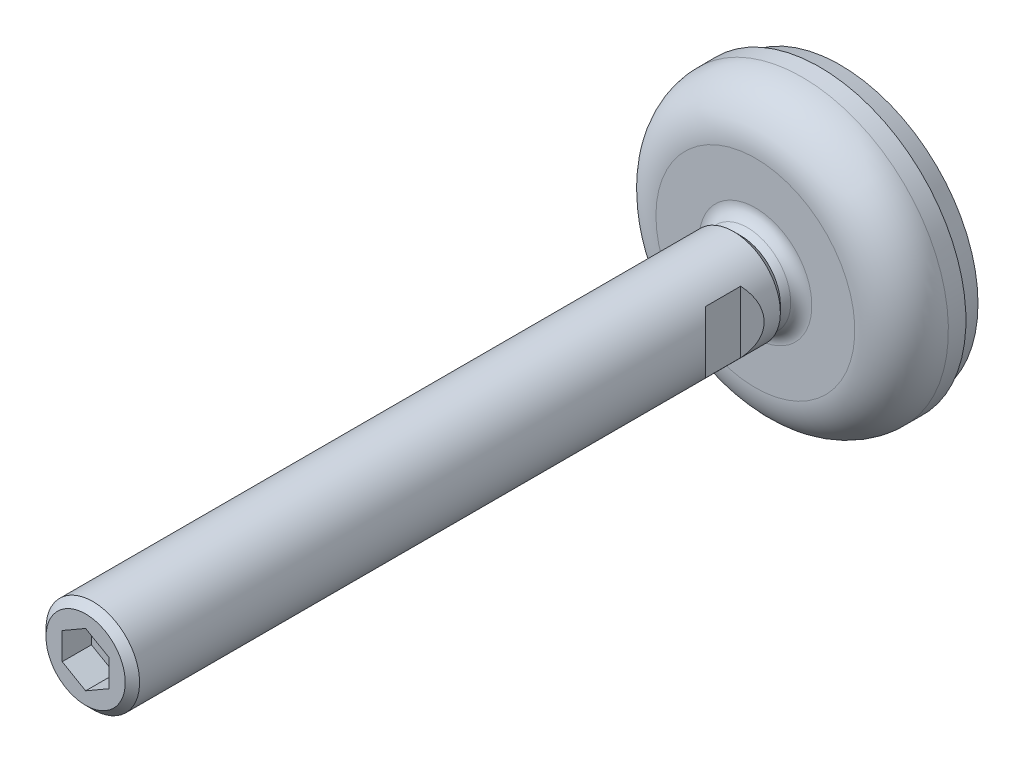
ISO-10303-21;
HEADER;
FILE_DESCRIPTION(('STEP AP214'),'2;1');
FILE_NAME('part.step','',(''),(''),'','','');
FILE_SCHEMA(('AUTOMOTIVE_DESIGN { 1 0 10303 214 1 1 1 1 }'));
ENDSEC;
DATA;
#1=APPLICATION_CONTEXT('core data for automotive mechanical design processes');
#2=APPLICATION_PROTOCOL_DEFINITION('international standard','automotive_design',2000,#1);
#3=PRODUCT_CONTEXT('',#1,'mechanical');
#4=PRODUCT('Part','Part','',(#3));
#5=PRODUCT_RELATED_PRODUCT_CATEGORY('part','',(#4));
#6=PRODUCT_DEFINITION_FORMATION('','',#4);
#7=PRODUCT_DEFINITION_CONTEXT('part definition',#1,'design');
#8=PRODUCT_DEFINITION('design','',#6,#7);
#9=PRODUCT_DEFINITION_SHAPE('','',#8);
#10=(LENGTH_UNIT() NAMED_UNIT(*) SI_UNIT(.MILLI.,.METRE.));
#11=(NAMED_UNIT(*) PLANE_ANGLE_UNIT() SI_UNIT($,.RADIAN.));
#12=(NAMED_UNIT(*) SI_UNIT($,.STERADIAN.) SOLID_ANGLE_UNIT());
#13=UNCERTAINTY_MEASURE_WITH_UNIT(LENGTH_MEASURE(1.E-05),#10,'distance_accuracy_value','');
#14=(GEOMETRIC_REPRESENTATION_CONTEXT(3) GLOBAL_UNCERTAINTY_ASSIGNED_CONTEXT((#13)) GLOBAL_UNIT_ASSIGNED_CONTEXT((#10,
#11,#12)) REPRESENTATION_CONTEXT('',''));
#15=CARTESIAN_POINT('',(0.,0.,0.));
#16=DIRECTION('',(0.,0.,1.));
#17=DIRECTION('',(1.,0.,0.));
#18=AXIS2_PLACEMENT_3D('',#15,#16,#17);
#19=CARTESIAN_POINT('',(0.,0.,18.227));
#20=DIRECTION('',(0.,0.,-1.));
#21=DIRECTION('',(-1.,0.,0.));
#22=AXIS2_PLACEMENT_3D('',#19,#20,#21);
#23=CYLINDRICAL_SURFACE('',#22,8.);
#24=CARTESIAN_POINT('',(0.,0.,23.));
#25=DIRECTION('',(-0.707106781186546,0.,0.707106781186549));
#26=DIRECTION('',(-0.707106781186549,0.,-0.707106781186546));
#27=AXIS2_PLACEMENT_3D('',#24,#25,#26);
#28=ELLIPSE('',#27,11.3137084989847,8.);
#29=CARTESIAN_POINT('',(6.,5.29150262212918,29.));
#30=VERTEX_POINT('',#29);
#31=CARTESIAN_POINT('',(6.,-5.29150262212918,29.));
#32=VERTEX_POINT('',#31);
#33=EDGE_CURVE('E9',#30,#32,#28,.F.);
#34=ORIENTED_EDGE('',*,*,#33,.F.);
#35=DIRECTION('',(0.,0.,-1.));
#36=VECTOR('',#35,1.);
#37=CARTESIAN_POINT('',(6.,5.29150262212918,18.227));
#38=LINE('',#37,#36);
#39=CARTESIAN_POINT('',(6.,5.29150262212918,23.));
#40=VERTEX_POINT('',#39);
#41=EDGE_CURVE('E22',#40,#30,#38,.F.);
#42=ORIENTED_EDGE('',*,*,#41,.F.);
#43=CARTESIAN_POINT('',(0.,0.,29.));
#44=DIRECTION('',(-0.707106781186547,0.,-0.707106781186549));
#45=DIRECTION('',(0.707106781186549,0.,-0.707106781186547));
#46=AXIS2_PLACEMENT_3D('',#43,#44,#45);
#47=ELLIPSE('',#46,11.3137084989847,8.);
#48=CARTESIAN_POINT('',(6.,-5.29150262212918,23.));
#49=VERTEX_POINT('',#48);
#50=EDGE_CURVE('E89',#49,#40,#47,.F.);
#51=ORIENTED_EDGE('',*,*,#50,.F.);
#52=DIRECTION('',(0.,0.,-1.));
#53=VECTOR('',#52,1.);
#54=CARTESIAN_POINT('',(6.,-5.29150262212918,18.227));
#55=LINE('',#54,#53);
#56=EDGE_CURVE('E94',#32,#49,#55,.T.);
#57=ORIENTED_EDGE('',*,*,#56,.F.);
#58=EDGE_LOOP('',(#34,#42,#51,#57));
#59=FACE_BOUND('',#58,.T.);
#60=DIRECTION('',(0.,0.,-1.));
#61=VECTOR('',#60,1.);
#62=CARTESIAN_POINT('',(-6.,-5.29150262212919,18.227));
#63=LINE('',#62,#61);
#64=CARTESIAN_POINT('',(-6.,-5.29150262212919,23.));
#65=VERTEX_POINT('',#64);
#66=CARTESIAN_POINT('',(-6.,-5.29150262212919,29.));
#67=VERTEX_POINT('',#66);
#68=EDGE_CURVE('E95',#65,#67,#63,.F.);
#69=ORIENTED_EDGE('',*,*,#68,.F.);
#70=CARTESIAN_POINT('',(0.,0.,29.));
#71=DIRECTION('',(0.707106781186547,0.,-0.707106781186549));
#72=DIRECTION('',(-0.707106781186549,0.,-0.707106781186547));
#73=AXIS2_PLACEMENT_3D('',#70,#71,#72);
#74=ELLIPSE('',#73,11.3137084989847,8.);
#75=CARTESIAN_POINT('',(-6.,5.29150262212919,23.));
#76=VERTEX_POINT('',#75);
#77=EDGE_CURVE('E110',#76,#65,#74,.F.);
#78=ORIENTED_EDGE('',*,*,#77,.F.);
#79=DIRECTION('',(0.,0.,-1.));
#80=VECTOR('',#79,1.);
#81=CARTESIAN_POINT('',(-6.,5.29150262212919,18.227));
#82=LINE('',#81,#80);
#83=CARTESIAN_POINT('',(-6.,5.29150262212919,29.));
#84=VERTEX_POINT('',#83);
#85=EDGE_CURVE('E112',#84,#76,#82,.T.);
#86=ORIENTED_EDGE('',*,*,#85,.F.);
#87=CARTESIAN_POINT('',(0.,0.,23.));
#88=DIRECTION('',(0.707106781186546,0.,0.707106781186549));
#89=DIRECTION('',(0.707106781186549,0.,-0.707106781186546));
#90=AXIS2_PLACEMENT_3D('',#87,#88,#89);
#91=ELLIPSE('',#90,11.3137084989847,8.);
#92=EDGE_CURVE('E108',#67,#84,#91,.F.);
#93=ORIENTED_EDGE('',*,*,#92,.F.);
#94=EDGE_LOOP('',(#69,#78,#86,#93));
#95=FACE_BOUND('',#94,.T.);
#96=CARTESIAN_POINT('',(0.,0.,127.773));
#97=DIRECTION('',(0.,0.,-1.));
#98=DIRECTION('',(0.,1.,0.));
#99=AXIS2_PLACEMENT_3D('',#96,#97,#98);
#100=CIRCLE('',#99,8.);
#101=CARTESIAN_POINT('',(0.,8.,127.773));
#102=VERTEX_POINT('',#101);
#103=EDGE_CURVE('E118',#102,#102,#100,.T.);
#104=ORIENTED_EDGE('',*,*,#103,.T.);
#105=EDGE_LOOP('',(#104));
#106=FACE_BOUND('',#105,.T.);
#107=CARTESIAN_POINT('',(0.,0.,18.227));
#108=DIRECTION('',(0.,0.,-1.));
#109=DIRECTION('',(0.,1.,0.));
#110=AXIS2_PLACEMENT_3D('',#107,#108,#109);
#111=CIRCLE('',#110,8.);
#112=CARTESIAN_POINT('',(0.,8.,18.227));
#113=VERTEX_POINT('',#112);
#114=EDGE_CURVE('E138',#113,#113,#111,.T.);
#115=ORIENTED_EDGE('',*,*,#114,.F.);
#116=EDGE_LOOP('',(#115));
#117=FACE_BOUND('',#116,.T.);
#118=ADVANCED_FACE('F14',(#59,#95,#106,#117),#23,.T.);
#119=CARTESIAN_POINT('',(0.,0.,17.));
#120=DIRECTION('',(0.,0.,1.));
#121=DIRECTION('',(1.,0.,0.));
#122=AXIS2_PLACEMENT_3D('',#119,#120,#121);
#123=CONICAL_SURFACE('',#122,6.773,0.785398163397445);
#124=ORIENTED_EDGE('',*,*,#114,.T.);
#125=EDGE_LOOP('',(#124));
#126=FACE_BOUND('',#125,.T.);
#127=CARTESIAN_POINT('',(0.,0.,17.));
#128=DIRECTION('',(0.,0.,-1.));
#129=DIRECTION('',(-1.,0.,0.));
#130=AXIS2_PLACEMENT_3D('',#127,#128,#129);
#131=CIRCLE('',#130,6.773);
#132=CARTESIAN_POINT('',(-6.773,0.,17.));
#133=VERTEX_POINT('',#132);
#134=EDGE_CURVE('E141',#133,#133,#131,.T.);
#135=ORIENTED_EDGE('',*,*,#134,.F.);
#136=EDGE_LOOP('',(#135));
#137=FACE_BOUND('',#136,.T.);
#138=ADVANCED_FACE('F205',(#126,#137),#123,.T.);
#139=CARTESIAN_POINT('',(2.40883454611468,0.,10.942449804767));
#140=DIRECTION('',(0.,1.,0.));
#141=DIRECTION('',(-0.218984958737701,0.,-0.975728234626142));
#142=AXIS2_PLACEMENT_3D('',#139,#140,#141);
#143=CIRCLE('',#142,10.9999999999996);
#144=TRIMMED_CURVE('',#143,(PARAMETER_VALUE(0.)),(PARAMETER_VALUE(2.70004453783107)),.T.,.PARAMETER.);
#145=CARTESIAN_POINT('',(0.,0.,10.942449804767));
#146=DIRECTION('',(0.,0.,-1.));
#147=AXIS1_PLACEMENT('',#145,#146);
#148=SURFACE_OF_REVOLUTION('',#144,#147);
#149=ORIENTED_EDGE('',*,*,#134,.T.);
#150=EDGE_LOOP('',(#149));
#151=FACE_BOUND('',#150,.T.);
#152=CARTESIAN_POINT('',(0.,0.,15.8782314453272));
#153=DIRECTION('',(0.,0.,-1.));
#154=DIRECTION('',(-1.,0.,0.));
#155=AXIS2_PLACEMENT_3D('',#152,#153,#154);
#156=CIRCLE('',#155,7.42163134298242);
#157=CARTESIAN_POINT('',(-7.42163134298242,0.,15.8782314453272));
#158=VERTEX_POINT('',#157);
#159=EDGE_CURVE('E124',#158,#158,#156,.T.);
#160=ORIENTED_EDGE('',*,*,#159,.F.);
#161=EDGE_LOOP('',(#160));
#162=FACE_BOUND('',#161,.T.);
#163=ADVANCED_FACE('F211',(#151,#162),#148,.F.);
#164=CARTESIAN_POINT('',(0.,0.,17.));
#165=DIRECTION('',(0.,0.,-1.));
#166=DIRECTION('',(-1.,0.,0.));
#167=AXIS2_PLACEMENT_3D('',#164,#165,#166);
#168=TOROIDAL_SURFACE('',#167,9.65582813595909,2.5);
#169=CARTESIAN_POINT('',(0.,0.,14.5));
#170=DIRECTION('',(0.,0.,-1.));
#171=DIRECTION('',(-1.,0.,0.));
#172=AXIS2_PLACEMENT_3D('',#169,#170,#171);
#173=CIRCLE('',#172,9.65582813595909);
#174=CARTESIAN_POINT('',(-9.65582813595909,0.,14.5));
#175=VERTEX_POINT('',#174);
#176=EDGE_CURVE('E120',#175,#175,#173,.T.);
#177=ORIENTED_EDGE('',*,*,#176,.F.);
#178=EDGE_LOOP('',(#177));
#179=FACE_BOUND('',#178,.T.);
#180=ORIENTED_EDGE('',*,*,#159,.T.);
#181=EDGE_LOOP('',(#180));
#182=FACE_BOUND('',#181,.T.);
#183=ADVANCED_FACE('F220',(#179,#182),#168,.F.);
#184=CARTESIAN_POINT('',(-17.,17.,14.5));
#185=CARTESIAN_POINT('',(-17.,-17.,14.5));
#186=CARTESIAN_POINT('',(-17.,-17.34,14.5));
#187=B_SPLINE_CURVE_WITH_KNOTS('',1,(#184,#185,#186),.UNSPECIFIED.,.F.,.F.,(2,1,2),(0.,1.,1.01),.UNSPECIFIED.);
#188=DIRECTION('',(1.,0.,0.));
#189=VECTOR('',#188,1.);
#190=SURFACE_OF_LINEAR_EXTRUSION('',#187,#189);
#191=ORIENTED_EDGE('',*,*,#176,.T.);
#192=EDGE_LOOP('',(#191));
#193=FACE_BOUND('',#192,.T.);
#194=CARTESIAN_POINT('',(0.,0.,14.5));
#195=DIRECTION('',(0.,0.,-1.));
#196=DIRECTION('',(-1.,0.,0.));
#197=AXIS2_PLACEMENT_3D('',#194,#195,#196);
#198=CIRCLE('',#197,17.);
#199=CARTESIAN_POINT('',(-17.,0.,14.5));
#200=VERTEX_POINT('',#199);
#201=EDGE_CURVE('E123',#200,#200,#198,.T.);
#202=ORIENTED_EDGE('',*,*,#201,.F.);
#203=EDGE_LOOP('',(#202));
#204=FACE_BOUND('',#203,.T.);
#205=ADVANCED_FACE('F160',(#193,#204),#190,.T.);
#206=CARTESIAN_POINT('',(0.,0.,6.5));
#207=DIRECTION('',(0.,0.,-1.));
#208=DIRECTION('',(-1.,0.,0.));
#209=AXIS2_PLACEMENT_3D('',#206,#207,#208);
#210=TOROIDAL_SURFACE('',#209,17.,8.);
#211=ORIENTED_EDGE('',*,*,#201,.T.);
#212=EDGE_LOOP('',(#211));
#213=FACE_BOUND('',#212,.T.);
#214=CARTESIAN_POINT('',(0.,0.,6.5));
#215=DIRECTION('',(0.,0.,-1.));
#216=DIRECTION('',(0.,1.,0.));
#217=AXIS2_PLACEMENT_3D('',#214,#215,#216);
#218=CIRCLE('',#217,25.);
#219=CARTESIAN_POINT('',(0.,25.,6.5));
#220=VERTEX_POINT('',#219);
#221=EDGE_CURVE('E127',#220,#220,#218,.T.);
#222=ORIENTED_EDGE('',*,*,#221,.F.);
#223=EDGE_LOOP('',(#222));
#224=FACE_BOUND('',#223,.T.);
#225=ADVANCED_FACE('F155',(#213,#224),#210,.T.);
#226=CARTESIAN_POINT('',(0.,0.,3.5));
#227=DIRECTION('',(0.,0.,-1.));
#228=DIRECTION('',(-1.,0.,0.));
#229=AXIS2_PLACEMENT_3D('',#226,#227,#228);
#230=CYLINDRICAL_SURFACE('',#229,25.);
#231=CARTESIAN_POINT('',(0.,0.,3.5));
#232=DIRECTION('',(0.,0.,-1.));
#233=DIRECTION('',(-1.,0.,0.));
#234=AXIS2_PLACEMENT_3D('',#231,#232,#233);
#235=CIRCLE('',#234,25.);
#236=CARTESIAN_POINT('',(-25.,0.,3.5));
#237=VERTEX_POINT('',#236);
#238=EDGE_CURVE('E128',#237,#237,#235,.T.);
#239=ORIENTED_EDGE('',*,*,#238,.F.);
#240=EDGE_LOOP('',(#239));
#241=FACE_BOUND('',#240,.T.);
#242=ORIENTED_EDGE('',*,*,#221,.T.);
#243=EDGE_LOOP('',(#242));
#244=FACE_BOUND('',#243,.T.);
#245=ADVANCED_FACE('F159',(#241,#244),#230,.T.);
#246=CARTESIAN_POINT('',(-25.3000021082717,-25.,3.5));
#247=DIRECTION('',(0.,0.,-1.));
#248=DIRECTION('',(0.,1.,0.));
#249=AXIS2_PLACEMENT_3D('',#246,#247,#248);
#250=PLANE('',#249);
#251=CARTESIAN_POINT('',(0.,0.,3.5));
#252=DIRECTION('',(0.,0.,1.));
#253=DIRECTION('',(1.,0.,0.));
#254=AXIS2_PLACEMENT_3D('',#251,#252,#253);
#255=CIRCLE('',#254,24.5);
#256=CARTESIAN_POINT('',(24.5,0.,3.5));
#257=VERTEX_POINT('',#256);
#258=EDGE_CURVE('E131',#257,#257,#255,.F.);
#259=ORIENTED_EDGE('',*,*,#258,.F.);
#260=EDGE_LOOP('',(#259));
#261=FACE_BOUND('',#260,.T.);
#262=ORIENTED_EDGE('',*,*,#238,.T.);
#263=EDGE_LOOP('',(#262));
#264=FACE_BOUND('',#263,.T.);
#265=ADVANCED_FACE('F165',(#261,#264),#250,.T.);
#266=CARTESIAN_POINT('',(-23.844926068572,-23.562177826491,0.));
#267=DIRECTION('',(0.,0.,-1.));
#268=DIRECTION('',(0.,1.,0.));
#269=AXIS2_PLACEMENT_3D('',#266,#267,#268);
#270=PLANE('',#269);
#271=CARTESIAN_POINT('',(0.,0.,0.));
#272=DIRECTION('',(0.,0.,1.));
#273=DIRECTION('',(1.,0.,0.));
#274=AXIS2_PLACEMENT_3D('',#271,#272,#273);
#275=CIRCLE('',#274,23.562177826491);
#276=CARTESIAN_POINT('',(23.562177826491,0.,0.));
#277=VERTEX_POINT('',#276);
#278=EDGE_CURVE('E114',#277,#277,#275,.T.);
#279=ORIENTED_EDGE('',*,*,#278,.F.);
#280=EDGE_LOOP('',(#279));
#281=FACE_BOUND('',#280,.T.);
#282=ADVANCED_FACE('F168',(#281),#270,.T.);
#283=CARTESIAN_POINT('',(0.,0.,0.));
#284=DIRECTION('',(0.,0.,1.));
#285=DIRECTION('',(1.,0.,0.));
#286=AXIS2_PLACEMENT_3D('',#283,#284,#285);
#287=CONICAL_SURFACE('',#286,23.562177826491,0.26179938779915);
#288=ORIENTED_EDGE('',*,*,#258,.T.);
#289=EDGE_LOOP('',(#288));
#290=FACE_BOUND('',#289,.T.);
#291=ORIENTED_EDGE('',*,*,#278,.T.);
#292=EDGE_LOOP('',(#291));
#293=FACE_BOUND('',#292,.T.);
#294=ADVANCED_FACE('F16',(#290,#293),#287,.T.);
#295=CARTESIAN_POINT('',(-4.,-4.67422777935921,124.));
#296=DIRECTION('',(0.,0.,1.));
#297=DIRECTION('',(1.,0.,0.));
#298=AXIS2_PLACEMENT_3D('',#295,#296,#297);
#299=PLANE('',#298);
#300=DIRECTION('',(0.866025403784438,0.5,0.));
#301=VECTOR('',#300,1.);
#302=CARTESIAN_POINT('',(-2.,3.46410161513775,124.));
#303=LINE('',#302,#301);
#304=CARTESIAN_POINT('',(-4.,2.3094010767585,124.));
#305=VERTEX_POINT('',#304);
#306=CARTESIAN_POINT('',(1.08254317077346E-07,4.61880209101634,124.));
#307=VERTEX_POINT('',#306);
#308=EDGE_CURVE('E317',#305,#307,#303,.T.);
#309=ORIENTED_EDGE('',*,*,#308,.F.);
#310=DIRECTION('',(0.,1.,0.));
#311=VECTOR('',#310,1.);
#312=CARTESIAN_POINT('',(-4.,0.,124.));
#313=LINE('',#312,#311);
#314=CARTESIAN_POINT('',(-4.,-2.3094010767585,124.));
#315=VERTEX_POINT('',#314);
#316=EDGE_CURVE('E311',#315,#305,#313,.T.);
#317=ORIENTED_EDGE('',*,*,#316,.F.);
#318=DIRECTION('',(-0.866025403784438,0.5,0.));
#319=VECTOR('',#318,1.);
#320=CARTESIAN_POINT('',(-2.,-3.46410161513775,124.));
#321=LINE('',#320,#319);
#322=CARTESIAN_POINT('',(-2.16508673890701E-07,-4.61880202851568,124.));
#323=VERTEX_POINT('',#322);
#324=EDGE_CURVE('E308',#323,#315,#321,.T.);
#325=ORIENTED_EDGE('',*,*,#324,.F.);
#326=DIRECTION('',(-0.866025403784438,-0.5,0.));
#327=VECTOR('',#326,1.);
#328=CARTESIAN_POINT('',(2.,-3.46410161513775,124.));
#329=LINE('',#328,#327);
#330=CARTESIAN_POINT('',(4.,-2.3094010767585,124.));
#331=VERTEX_POINT('',#330);
#332=EDGE_CURVE('E300',#331,#323,#329,.T.);
#333=ORIENTED_EDGE('',*,*,#332,.F.);
#334=DIRECTION('',(0.,-1.,0.));
#335=VECTOR('',#334,1.);
#336=CARTESIAN_POINT('',(4.,0.,124.));
#337=LINE('',#336,#335);
#338=CARTESIAN_POINT('',(4.,2.3094010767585,124.));
#339=VERTEX_POINT('',#338);
#340=EDGE_CURVE('E292',#339,#331,#337,.T.);
#341=ORIENTED_EDGE('',*,*,#340,.F.);
#342=DIRECTION('',(0.866025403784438,-0.5,0.));
#343=VECTOR('',#342,1.);
#344=CARTESIAN_POINT('',(2.,3.46410161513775,124.));
#345=LINE('',#344,#343);
#346=EDGE_CURVE('E289',#307,#339,#345,.T.);
#347=ORIENTED_EDGE('',*,*,#346,.F.);
#348=EDGE_LOOP('',(#309,#317,#325,#333,#341,#347));
#349=FACE_BOUND('',#348,.T.);
#350=ADVANCED_FACE('F177',(#349),#299,.T.);
#351=CARTESIAN_POINT('',(4.,2.3094010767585,129.));
#352=DIRECTION('',(-0.5,-0.866025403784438,0.));
#353=DIRECTION('',(-0.866025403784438,0.5,0.));
#354=AXIS2_PLACEMENT_3D('',#351,#352,#353);
#355=PLANE('',#354);
#356=ORIENTED_EDGE('',*,*,#346,.T.);
#357=DIRECTION('',(0.,0.,-1.));
#358=VECTOR('',#357,1.);
#359=CARTESIAN_POINT('',(4.,2.3094010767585,129.));
#360=LINE('',#359,#358);
#361=CARTESIAN_POINT('',(4.,2.3094010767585,129.));
#362=VERTEX_POINT('',#361);
#363=EDGE_CURVE('E287',#362,#339,#360,.T.);
#364=ORIENTED_EDGE('',*,*,#363,.F.);
#365=CARTESIAN_POINT('',(0.,4.61880215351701,129.));
#366=CARTESIAN_POINT('',(0.166666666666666,4.52257710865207,129.));
#367=CARTESIAN_POINT('',(0.333333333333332,4.42635206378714,129.));
#368=CARTESIAN_POINT('',(0.666666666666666,4.23390197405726,129.));
#369=CARTESIAN_POINT('',(0.833333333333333,4.13767692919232,129.));
#370=CARTESIAN_POINT('',(1.16666666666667,3.94522683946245,129.));
#371=CARTESIAN_POINT('',(1.33333333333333,3.84900179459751,129.));
#372=CARTESIAN_POINT('',(1.66666666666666,3.65655170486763,129.));
#373=CARTESIAN_POINT('',(1.83333333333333,3.56032666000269,129.));
#374=CARTESIAN_POINT('',(2.16666666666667,3.36787657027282,129.));
#375=CARTESIAN_POINT('',(2.33333333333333,3.27165152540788,129.));
#376=CARTESIAN_POINT('',(2.66666666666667,3.079201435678,129.));
#377=CARTESIAN_POINT('',(2.83333333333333,2.98297639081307,129.));
#378=CARTESIAN_POINT('',(3.16666666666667,2.79052630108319,129.));
#379=CARTESIAN_POINT('',(3.33333333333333,2.69430125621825,129.));
#380=CARTESIAN_POINT('',(3.66666666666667,2.50185116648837,129.));
#381=CARTESIAN_POINT('',(3.83333333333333,2.40562612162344,129.));
#382=CARTESIAN_POINT('',(4.,2.3094010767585,129.));
#383=B_SPLINE_CURVE_WITH_KNOTS('',3,(#365,#366,#367,#368,#369,#370,#371,#372,#373,#374,#375,
#376,#377,#378,#379,#380,#381,#382),.UNSPECIFIED.,.F.,.F.,(4,2,2,2,2,2,2,2,4),(0.,
0.577350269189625,1.15470053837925,1.73205080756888,2.3094010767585,2.88675134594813,
3.46410161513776,4.04145188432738,4.61880215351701),.UNSPECIFIED.);
#384=CARTESIAN_POINT('',(-6.2517213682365E-08,4.61880211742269,129.));
#385=VERTEX_POINT('',#384);
#386=EDGE_CURVE('E233',#385,#362,#383,.T.);
#387=ORIENTED_EDGE('',*,*,#386,.F.);
#388=DIRECTION('',(0.,0.,-1.));
#389=VECTOR('',#388,1.);
#390=CARTESIAN_POINT('',(0.,4.61880215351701,129.));
#391=LINE('',#390,#389);
#392=EDGE_CURVE('E285',#385,#307,#391,.T.);
#393=ORIENTED_EDGE('',*,*,#392,.T.);
#394=EDGE_LOOP('',(#356,#364,#387,#393));
#395=FACE_BOUND('',#394,.T.);
#396=ADVANCED_FACE('F185',(#395),#355,.T.);
#397=CARTESIAN_POINT('',(0.,4.61880215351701,129.));
#398=DIRECTION('',(0.5,-0.866025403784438,0.));
#399=DIRECTION('',(-0.866025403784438,-0.5,0.));
#400=AXIS2_PLACEMENT_3D('',#397,#398,#399);
#401=PLANE('',#400);
#402=ORIENTED_EDGE('',*,*,#308,.T.);
#403=ORIENTED_EDGE('',*,*,#392,.F.);
#404=CARTESIAN_POINT('',(-4.,2.3094010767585,129.));
#405=CARTESIAN_POINT('',(-3.83333333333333,2.40562612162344,129.));
#406=CARTESIAN_POINT('',(-3.66666666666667,2.50185116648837,129.));
#407=CARTESIAN_POINT('',(-3.33333333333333,2.69430125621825,129.));
#408=CARTESIAN_POINT('',(-3.16666666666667,2.79052630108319,129.));
#409=CARTESIAN_POINT('',(-2.83333333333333,2.98297639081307,129.));
#410=CARTESIAN_POINT('',(-2.66666666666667,3.079201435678,129.));
#411=CARTESIAN_POINT('',(-2.33333333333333,3.27165152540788,129.));
#412=CARTESIAN_POINT('',(-2.16666666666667,3.36787657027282,129.));
#413=CARTESIAN_POINT('',(-1.83333333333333,3.56032666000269,129.));
#414=CARTESIAN_POINT('',(-1.66666666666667,3.65655170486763,129.));
#415=CARTESIAN_POINT('',(-1.33333333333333,3.84900179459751,129.));
#416=CARTESIAN_POINT('',(-1.16666666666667,3.94522683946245,129.));
#417=CARTESIAN_POINT('',(-0.833333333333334,4.13767692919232,129.));
#418=CARTESIAN_POINT('',(-0.666666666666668,4.23390197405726,129.));
#419=CARTESIAN_POINT('',(-0.333333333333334,4.42635206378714,129.));
#420=CARTESIAN_POINT('',(-0.166666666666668,4.52257710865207,129.));
#421=CARTESIAN_POINT('',(0.,4.61880215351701,129.));
#422=B_SPLINE_CURVE_WITH_KNOTS('',3,(#404,#405,#406,#407,#408,#409,#410,#411,#412,#413,#414,
#415,#416,#417,#418,#419,#420,#421),.UNSPECIFIED.,.F.,.F.,(4,2,2,2,2,2,2,2,4),(0.,
0.577350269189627,1.15470053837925,1.73205080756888,2.3094010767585,2.88675134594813,
3.46410161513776,4.04145188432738,4.61880215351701),.UNSPECIFIED.);
#423=CARTESIAN_POINT('',(-4.,2.3094010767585,129.));
#424=VERTEX_POINT('',#423);
#425=EDGE_CURVE('E228',#424,#385,#422,.T.);
#426=ORIENTED_EDGE('',*,*,#425,.F.);
#427=DIRECTION('',(0.,0.,-1.));
#428=VECTOR('',#427,1.);
#429=CARTESIAN_POINT('',(-4.,2.3094010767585,129.));
#430=LINE('',#429,#428);
#431=EDGE_CURVE('E315',#424,#305,#430,.T.);
#432=ORIENTED_EDGE('',*,*,#431,.T.);
#433=EDGE_LOOP('',(#402,#403,#426,#432));
#434=FACE_BOUND('',#433,.T.);
#435=ADVANCED_FACE('F198',(#434),#401,.T.);
#436=CARTESIAN_POINT('',(-4.,2.3094010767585,129.));
#437=DIRECTION('',(1.,0.,0.));
#438=DIRECTION('',(0.,-1.,0.));
#439=AXIS2_PLACEMENT_3D('',#436,#437,#438);
#440=PLANE('',#439);
#441=ORIENTED_EDGE('',*,*,#316,.T.);
#442=ORIENTED_EDGE('',*,*,#431,.F.);
#443=DIRECTION('',(0.,1.,0.));
#444=VECTOR('',#443,1.);
#445=CARTESIAN_POINT('',(-4.,0.,129.));
#446=LINE('',#445,#444);
#447=CARTESIAN_POINT('',(-4.,-2.3094010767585,129.));
#448=VERTEX_POINT('',#447);
#449=EDGE_CURVE('E224',#448,#424,#446,.T.);
#450=ORIENTED_EDGE('',*,*,#449,.F.);
#451=DIRECTION('',(0.,0.,-1.));
#452=VECTOR('',#451,1.);
#453=CARTESIAN_POINT('',(-4.,-2.3094010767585,129.));
#454=LINE('',#453,#452);
#455=EDGE_CURVE('E307',#448,#315,#454,.T.);
#456=ORIENTED_EDGE('',*,*,#455,.T.);
#457=EDGE_LOOP('',(#441,#442,#450,#456));
#458=FACE_BOUND('',#457,.T.);
#459=ADVANCED_FACE('F313',(#458),#440,.T.);
#460=CARTESIAN_POINT('',(-4.,-2.3094010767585,129.));
#461=DIRECTION('',(0.5,0.866025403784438,0.));
#462=DIRECTION('',(0.866025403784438,-0.5,0.));
#463=AXIS2_PLACEMENT_3D('',#460,#461,#462);
#464=PLANE('',#463);
#465=ORIENTED_EDGE('',*,*,#324,.T.);
#466=ORIENTED_EDGE('',*,*,#455,.F.);
#467=CARTESIAN_POINT('',(0.,-4.61880215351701,129.));
#468=CARTESIAN_POINT('',(-0.166666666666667,-4.52257710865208,129.));
#469=CARTESIAN_POINT('',(-0.333333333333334,-4.42635206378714,129.));
#470=CARTESIAN_POINT('',(-0.666666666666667,-4.23390197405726,129.));
#471=CARTESIAN_POINT('',(-0.833333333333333,-4.13767692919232,129.));
#472=CARTESIAN_POINT('',(-1.16666666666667,-3.94522683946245,129.));
#473=CARTESIAN_POINT('',(-1.33333333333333,-3.84900179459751,129.));
#474=CARTESIAN_POINT('',(-1.66666666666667,-3.65655170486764,129.));
#475=CARTESIAN_POINT('',(-1.83333333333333,-3.5603266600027,129.));
#476=CARTESIAN_POINT('',(-2.16666666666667,-3.36787657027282,129.));
#477=CARTESIAN_POINT('',(-2.33333333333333,-3.27165152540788,129.));
#478=CARTESIAN_POINT('',(-2.66666666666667,-3.07920143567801,129.));
#479=CARTESIAN_POINT('',(-2.83333333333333,-2.98297639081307,129.));
#480=CARTESIAN_POINT('',(-3.16666666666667,-2.7905263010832,129.));
#481=CARTESIAN_POINT('',(-3.33333333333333,-2.69430125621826,129.));
#482=CARTESIAN_POINT('',(-3.66666666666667,-2.50185116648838,129.));
#483=CARTESIAN_POINT('',(-3.83333333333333,-2.40562612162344,129.));
#484=CARTESIAN_POINT('',(-4.,-2.30940107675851,129.));
#485=B_SPLINE_CURVE_WITH_KNOTS('',3,(#467,#468,#469,#470,#471,#472,#473,#474,#475,#476,#477,
#478,#479,#480,#481,#482,#483,#484),.UNSPECIFIED.,.F.,.F.,(4,2,2,2,2,2,2,2,4),(0.,
0.577350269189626,1.15470053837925,1.73205080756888,2.3094010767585,2.88675134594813,
3.46410161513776,4.04145188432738,4.61880215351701),.UNSPECIFIED.);
#486=CARTESIAN_POINT('',(-6.25172143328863E-08,-4.61880211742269,129.));
#487=VERTEX_POINT('',#486);
#488=EDGE_CURVE('E229',#487,#448,#485,.T.);
#489=ORIENTED_EDGE('',*,*,#488,.F.);
#490=DIRECTION('',(0.,0.,-1.));
#491=VECTOR('',#490,1.);
#492=CARTESIAN_POINT('',(0.,-4.61880215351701,129.));
#493=LINE('',#492,#491);
#494=EDGE_CURVE('E265',#323,#487,#493,.F.);
#495=ORIENTED_EDGE('',*,*,#494,.F.);
#496=EDGE_LOOP('',(#465,#466,#489,#495));
#497=FACE_BOUND('',#496,.T.);
#498=ADVANCED_FACE('F305',(#497),#464,.T.);
#499=CARTESIAN_POINT('',(0.,-4.61880215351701,129.));
#500=DIRECTION('',(-0.5,0.866025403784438,0.));
#501=DIRECTION('',(0.866025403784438,0.5,0.));
#502=AXIS2_PLACEMENT_3D('',#499,#500,#501);
#503=PLANE('',#502);
#504=ORIENTED_EDGE('',*,*,#332,.T.);
#505=ORIENTED_EDGE('',*,*,#494,.T.);
#506=CARTESIAN_POINT('',(4.,-2.30940107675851,129.));
#507=CARTESIAN_POINT('',(3.83333333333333,-2.40562612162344,129.));
#508=CARTESIAN_POINT('',(3.66666666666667,-2.50185116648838,129.));
#509=CARTESIAN_POINT('',(3.33333333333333,-2.69430125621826,129.));
#510=CARTESIAN_POINT('',(3.16666666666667,-2.7905263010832,129.));
#511=CARTESIAN_POINT('',(2.83333333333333,-2.98297639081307,129.));
#512=CARTESIAN_POINT('',(2.66666666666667,-3.07920143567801,129.));
#513=CARTESIAN_POINT('',(2.33333333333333,-3.27165152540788,129.));
#514=CARTESIAN_POINT('',(2.16666666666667,-3.36787657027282,129.));
#515=CARTESIAN_POINT('',(1.83333333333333,-3.5603266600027,129.));
#516=CARTESIAN_POINT('',(1.66666666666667,-3.65655170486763,129.));
#517=CARTESIAN_POINT('',(1.33333333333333,-3.84900179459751,129.));
#518=CARTESIAN_POINT('',(1.16666666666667,-3.94522683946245,129.));
#519=CARTESIAN_POINT('',(0.833333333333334,-4.13767692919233,129.));
#520=CARTESIAN_POINT('',(0.666666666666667,-4.23390197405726,129.));
#521=CARTESIAN_POINT('',(0.333333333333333,-4.42635206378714,129.));
#522=CARTESIAN_POINT('',(0.166666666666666,-4.52257710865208,129.));
#523=CARTESIAN_POINT('',(0.,-4.61880215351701,129.));
#524=B_SPLINE_CURVE_WITH_KNOTS('',3,(#506,#507,#508,#509,#510,#511,#512,#513,#514,#515,#516,
#517,#518,#519,#520,#521,#522,#523),.UNSPECIFIED.,.F.,.F.,(4,2,2,2,2,2,2,2,4),(0.,
0.577350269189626,1.15470053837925,1.73205080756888,2.3094010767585,2.88675134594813,
3.46410161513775,4.04145188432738,4.61880215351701),.UNSPECIFIED.);
#525=CARTESIAN_POINT('',(4.,-2.3094010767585,129.));
#526=VERTEX_POINT('',#525);
#527=EDGE_CURVE('E119',#526,#487,#524,.T.);
#528=ORIENTED_EDGE('',*,*,#527,.F.);
#529=DIRECTION('',(0.,0.,-1.));
#530=VECTOR('',#529,1.);
#531=CARTESIAN_POINT('',(4.,-2.3094010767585,129.));
#532=LINE('',#531,#530);
#533=EDGE_CURVE('E258',#526,#331,#532,.T.);
#534=ORIENTED_EDGE('',*,*,#533,.T.);
#535=EDGE_LOOP('',(#504,#505,#528,#534));
#536=FACE_BOUND('',#535,.T.);
#537=ADVANCED_FACE('F248',(#536),#503,.T.);
#538=CARTESIAN_POINT('',(4.,-2.3094010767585,129.));
#539=DIRECTION('',(-1.,0.,0.));
#540=DIRECTION('',(0.,1.,0.));
#541=AXIS2_PLACEMENT_3D('',#538,#539,#540);
#542=PLANE('',#541);
#543=ORIENTED_EDGE('',*,*,#340,.T.);
#544=ORIENTED_EDGE('',*,*,#533,.F.);
#545=DIRECTION('',(0.,-1.,0.));
#546=VECTOR('',#545,1.);
#547=CARTESIAN_POINT('',(4.,0.,129.));
#548=LINE('',#547,#546);
#549=EDGE_CURVE('E230',#362,#526,#548,.T.);
#550=ORIENTED_EDGE('',*,*,#549,.F.);
#551=ORIENTED_EDGE('',*,*,#363,.T.);
#552=EDGE_LOOP('',(#543,#544,#550,#551));
#553=FACE_BOUND('',#552,.T.);
#554=ADVANCED_FACE('F294',(#553),#542,.T.);
#555=CARTESIAN_POINT('',(-6.85427810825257,6.773,129.));
#556=DIRECTION('',(0.,0.,1.));
#557=DIRECTION('',(0.,-1.,0.));
#558=AXIS2_PLACEMENT_3D('',#555,#556,#557);
#559=PLANE('',#558);
#560=ORIENTED_EDGE('',*,*,#549,.T.);
#561=ORIENTED_EDGE('',*,*,#527,.T.);
#562=ORIENTED_EDGE('',*,*,#488,.T.);
#563=ORIENTED_EDGE('',*,*,#449,.T.);
#564=ORIENTED_EDGE('',*,*,#425,.T.);
#565=ORIENTED_EDGE('',*,*,#386,.T.);
#566=EDGE_LOOP('',(#560,#561,#562,#563,#564,#565));
#567=FACE_BOUND('',#566,.T.);
#568=CARTESIAN_POINT('',(0.,0.,129.));
#569=DIRECTION('',(0.,0.,-1.));
#570=DIRECTION('',(-1.,0.,0.));
#571=AXIS2_PLACEMENT_3D('',#568,#569,#570);
#572=CIRCLE('',#571,6.773);
#573=CARTESIAN_POINT('',(-6.77300000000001,0.,129.));
#574=VERTEX_POINT('',#573);
#575=EDGE_CURVE('E115',#574,#574,#572,.T.);
#576=ORIENTED_EDGE('',*,*,#575,.F.);
#577=EDGE_LOOP('',(#576));
#578=FACE_BOUND('',#577,.T.);
#579=ADVANCED_FACE('F250',(#567,#578),#559,.T.);
#580=CARTESIAN_POINT('',(0.,0.,129.));
#581=DIRECTION('',(0.,0.,-1.));
#582=DIRECTION('',(-1.,0.,0.));
#583=AXIS2_PLACEMENT_3D('',#580,#581,#582);
#584=CONICAL_SURFACE('',#583,6.773,0.785398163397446);
#585=ORIENTED_EDGE('',*,*,#103,.F.);
#586=EDGE_LOOP('',(#585));
#587=FACE_BOUND('',#586,.T.);
#588=ORIENTED_EDGE('',*,*,#575,.T.);
#589=EDGE_LOOP('',(#588));
#590=FACE_BOUND('',#589,.T.);
#591=ADVANCED_FACE('F215',(#587,#590),#584,.T.);
#592=CARTESIAN_POINT('',(-8.,-10.,31.));
#593=DIRECTION('',(0.707106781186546,0.,0.707106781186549));
#594=DIRECTION('',(0.707106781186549,0.,-0.707106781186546));
#595=AXIS2_PLACEMENT_3D('',#592,#593,#594);
#596=PLANE('',#595);
#597=DIRECTION('',(0.,1.,0.));
#598=VECTOR('',#597,1.);
#599=CARTESIAN_POINT('',(-6.,-10.,29.));
#600=LINE('',#599,#598);
#601=EDGE_CURVE('E36',#67,#84,#600,.T.);
#602=ORIENTED_EDGE('',*,*,#601,.F.);
#603=ORIENTED_EDGE('',*,*,#92,.T.);
#604=EDGE_LOOP('',(#602,#603));
#605=FACE_BOUND('',#604,.T.);
#606=ADVANCED_FACE('F348',(#605),#596,.F.);
#607=CARTESIAN_POINT('',(-6.,-10.,23.));
#608=DIRECTION('',(0.707106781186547,0.,-0.707106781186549));
#609=DIRECTION('',(-0.707106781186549,0.,-0.707106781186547));
#610=AXIS2_PLACEMENT_3D('',#607,#608,#609);
#611=PLANE('',#610);
#612=ORIENTED_EDGE('',*,*,#77,.T.);
#613=DIRECTION('',(0.,1.,0.));
#614=VECTOR('',#613,1.);
#615=CARTESIAN_POINT('',(-6.,-10.,23.));
#616=LINE('',#615,#614);
#617=EDGE_CURVE('E324',#65,#76,#616,.T.);
#618=ORIENTED_EDGE('',*,*,#617,.T.);
#619=EDGE_LOOP('',(#612,#618));
#620=FACE_BOUND('',#619,.T.);
#621=ADVANCED_FACE('F342',(#620),#611,.F.);
#622=CARTESIAN_POINT('',(-6.,-10.,29.));
#623=DIRECTION('',(1.,0.,0.));
#624=DIRECTION('',(0.,0.,-1.));
#625=AXIS2_PLACEMENT_3D('',#622,#623,#624);
#626=PLANE('',#625);
#627=ORIENTED_EDGE('',*,*,#68,.T.);
#628=ORIENTED_EDGE('',*,*,#601,.T.);
#629=ORIENTED_EDGE('',*,*,#85,.T.);
#630=ORIENTED_EDGE('',*,*,#617,.F.);
#631=EDGE_LOOP('',(#627,#628,#629,#630));
#632=FACE_BOUND('',#631,.T.);
#633=ADVANCED_FACE('F334',(#632),#626,.F.);
#634=CARTESIAN_POINT('',(8.,-10.,31.));
#635=DIRECTION('',(-0.707106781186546,0.,0.707106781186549));
#636=DIRECTION('',(0.707106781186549,0.,0.707106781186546));
#637=AXIS2_PLACEMENT_3D('',#634,#635,#636);
#638=PLANE('',#637);
#639=DIRECTION('',(0.,1.,0.));
#640=VECTOR('',#639,1.);
#641=CARTESIAN_POINT('',(6.,-10.,29.));
#642=LINE('',#641,#640);
#643=EDGE_CURVE('E102',#32,#30,#642,.T.);
#644=ORIENTED_EDGE('',*,*,#643,.T.);
#645=ORIENTED_EDGE('',*,*,#33,.T.);
#646=EDGE_LOOP('',(#644,#645));
#647=FACE_BOUND('',#646,.T.);
#648=ADVANCED_FACE('F332',(#647),#638,.F.);
#649=CARTESIAN_POINT('',(6.,-10.,29.));
#650=DIRECTION('',(-1.,0.,0.));
#651=DIRECTION('',(0.,0.,1.));
#652=AXIS2_PLACEMENT_3D('',#649,#650,#651);
#653=PLANE('',#652);
#654=ORIENTED_EDGE('',*,*,#41,.T.);
#655=ORIENTED_EDGE('',*,*,#643,.F.);
#656=ORIENTED_EDGE('',*,*,#56,.T.);
#657=DIRECTION('',(0.,1.,0.));
#658=VECTOR('',#657,1.);
#659=CARTESIAN_POINT('',(6.,-10.,23.));
#660=LINE('',#659,#658);
#661=EDGE_CURVE('E28',#49,#40,#660,.T.);
#662=ORIENTED_EDGE('',*,*,#661,.T.);
#663=EDGE_LOOP('',(#654,#655,#656,#662));
#664=FACE_BOUND('',#663,.T.);
#665=ADVANCED_FACE('F99',(#664),#653,.F.);
#666=CARTESIAN_POINT('',(6.,-10.,23.));
#667=DIRECTION('',(-0.707106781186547,0.,-0.707106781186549));
#668=DIRECTION('',(-0.707106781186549,0.,0.707106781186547));
#669=AXIS2_PLACEMENT_3D('',#666,#667,#668);
#670=PLANE('',#669);
#671=ORIENTED_EDGE('',*,*,#50,.T.);
#672=ORIENTED_EDGE('',*,*,#661,.F.);
#673=EDGE_LOOP('',(#671,#672));
#674=FACE_BOUND('',#673,.T.);
#675=ADVANCED_FACE('F90',(#674),#670,.F.);
#676=CLOSED_SHELL('',(#118,#138,#163,#183,#205,#225,#245,#265,#282,#294,#350,#396,#435,#459,
#498,#537,#554,#579,#591,#606,#621,#633,#648,#665,#675));
#677=MANIFOLD_SOLID_BREP('B1',#676);
#678=ADVANCED_BREP_SHAPE_REPRESENTATION('',(#18,#677),#14);
#679=SHAPE_DEFINITION_REPRESENTATION(#9,#678);
ENDSEC;
END-ISO-10303-21;
